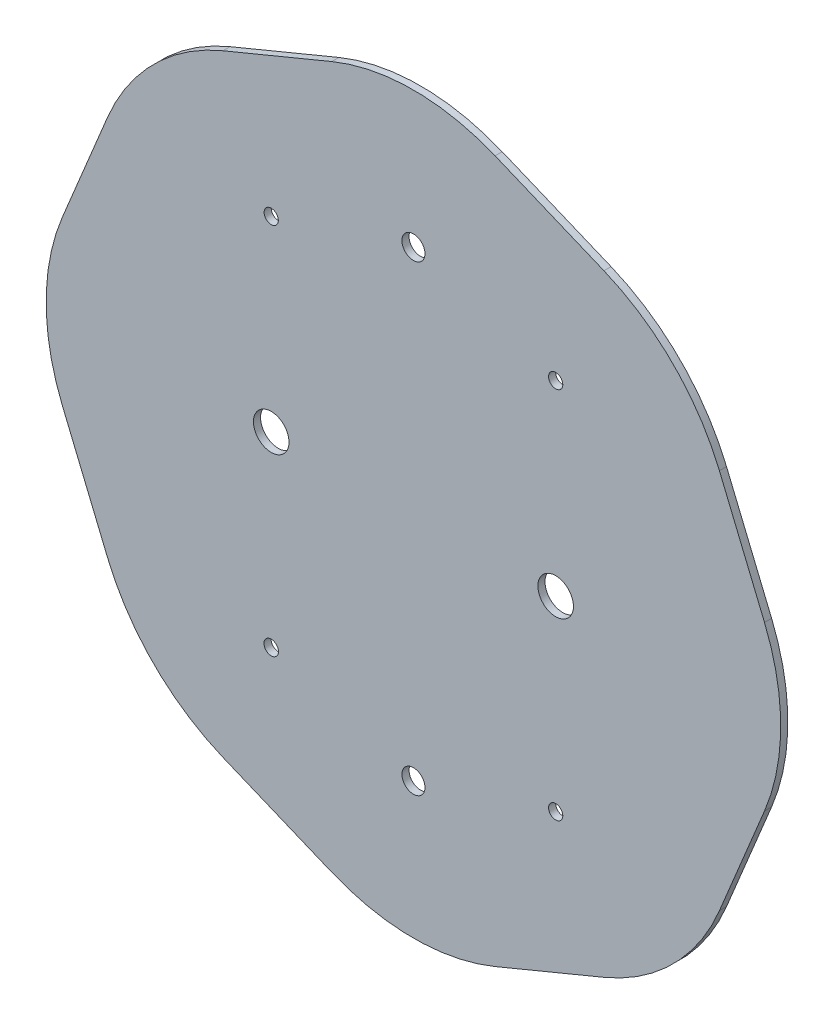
from build123d import *

# Parameters (mm, degrees)
BOSS_EXTRUDE1_DEPTH = 0.2
SKETCH2_R           = 0.323929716
SKETCH2_R_2         = 0.2
SKETCH2_R_3         = 0.203589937
SKETCH2_R_4         = 0.5
CUT_EXTRUDE1_DEPTH  = 15.60958532


with BuildPart() as part:
    # Sketch1 → Boss-Extrude1 (new body)
    with BuildSketch(Plane.XY):
        with BuildLine():
            Line((-2.296100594, 9.872845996), (-5.357568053, 8.604744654))
            ThreePointArc((-5.357568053, 8.604744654), (-7.304108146, 7.304108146), (-8.604744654, 5.357568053))
            Line((-8.604744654, 5.357568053), (-9.872845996, 2.296100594))
            ThreePointArc((-9.872845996, 2.296100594), (-10.329568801, 0), (-9.872845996, -2.296100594))
            Line((-9.872845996, -2.296100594), (-8.604744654, -5.357568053))
            ThreePointArc((-8.604744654, -5.357568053), (-7.304108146, -7.304108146), (-5.357568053, -8.604744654))
            Line((-5.357568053, -8.604744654), (-2.296100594, -9.872845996))
            ThreePointArc((-2.296100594, -9.872845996), (0, -10.329568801), (2.296100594, -9.872845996))
            Line((2.296100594, -9.872845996), (5.357568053, -8.604744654))
            ThreePointArc((5.357568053, -8.604744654), (7.304108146, -7.304108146), (8.604744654, -5.357568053))
            Line((8.604744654, -5.357568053), (9.872845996, -2.296100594))
            ThreePointArc((9.872845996, -2.296100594), (10.329568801, 0), (9.872845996, 2.296100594))
            Line((9.872845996, 2.296100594), (8.604744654, 5.357568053))
            ThreePointArc((8.604744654, 5.357568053), (7.304108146, 7.304108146), (5.357568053, 8.604744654))
            Line((5.357568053, 8.604744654), (2.296100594, 9.872845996))
            ThreePointArc((2.296100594, 9.872845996), (0, 10.329568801), (-2.296100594, 9.872845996))
        make_face()
    extrude(amount=BOSS_EXTRUDE1_DEPTH)

    # Sketch2 → Cut-Extrude1 (cut, through all)
    with BuildSketch(Plane(origin=(0, 0, 0), x_dir=(-1, 0, 0), z_dir=(0, 0, -1))):
        with Locations((0, -6.5)):
            Circle(SKETCH2_R)
        with Locations((-4, -5.25)):
            Circle(SKETCH2_R_2)
        with Locations((4, -5.25)):
            Circle(SKETCH2_R_3)
        with Locations((4, 5.25)):
            Circle(SKETCH2_R_2)
        with Locations((0, 6.5)):
            Circle(SKETCH2_R)
        with Locations((-4, 5.25)):
            Circle(SKETCH2_R_2)
        with Locations((4, 0)):
            Circle(SKETCH2_R_4)
        with Locations(Location((-4, 0, 0), (0, 0, 180))):
            Circle(SKETCH2_R_4)
    extrude(amount=-CUT_EXTRUDE1_DEPTH, mode=Mode.SUBTRACT)


solid = part.part
